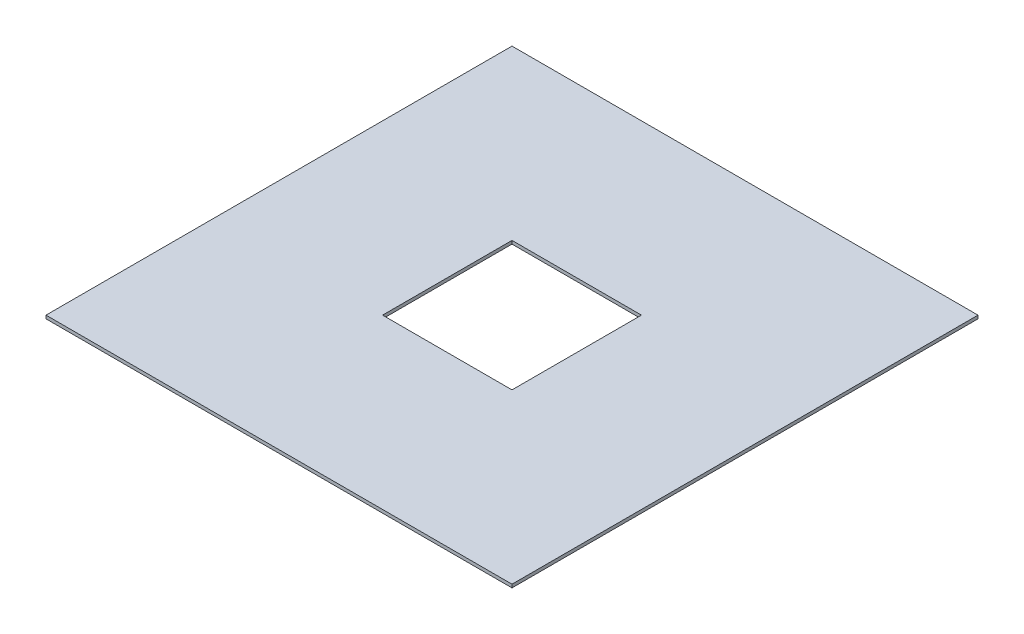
ISO-10303-21;
HEADER;
FILE_DESCRIPTION(('STEP AP214'),'2;1');
FILE_NAME('part.step','',(''),(''),'','','');
FILE_SCHEMA(('AUTOMOTIVE_DESIGN { 1 0 10303 214 1 1 1 1 }'));
ENDSEC;
DATA;
#1=APPLICATION_CONTEXT('core data for automotive mechanical design processes');
#2=APPLICATION_PROTOCOL_DEFINITION('international standard','automotive_design',2000,#1);
#3=PRODUCT_CONTEXT('',#1,'mechanical');
#4=PRODUCT('Part','Part','',(#3));
#5=PRODUCT_RELATED_PRODUCT_CATEGORY('part','',(#4));
#6=PRODUCT_DEFINITION_FORMATION('','',#4);
#7=PRODUCT_DEFINITION_CONTEXT('part definition',#1,'design');
#8=PRODUCT_DEFINITION('design','',#6,#7);
#9=PRODUCT_DEFINITION_SHAPE('','',#8);
#10=(LENGTH_UNIT() NAMED_UNIT(*) SI_UNIT(.MILLI.,.METRE.));
#11=(NAMED_UNIT(*) PLANE_ANGLE_UNIT() SI_UNIT($,.RADIAN.));
#12=(NAMED_UNIT(*) SI_UNIT($,.STERADIAN.) SOLID_ANGLE_UNIT());
#13=UNCERTAINTY_MEASURE_WITH_UNIT(LENGTH_MEASURE(1.E-05),#10,'distance_accuracy_value','');
#14=(GEOMETRIC_REPRESENTATION_CONTEXT(3) GLOBAL_UNCERTAINTY_ASSIGNED_CONTEXT((#13)) GLOBAL_UNIT_ASSIGNED_CONTEXT((#10,
#11,#12)) REPRESENTATION_CONTEXT('',''));
#15=CARTESIAN_POINT('',(0.,0.,0.));
#16=DIRECTION('',(0.,0.,1.));
#17=DIRECTION('',(1.,0.,0.));
#18=AXIS2_PLACEMENT_3D('',#15,#16,#17);
#19=CARTESIAN_POINT('',(457.2,6.35,-457.2));
#20=DIRECTION('',(-1.,0.,0.));
#21=DIRECTION('',(0.,0.,1.));
#22=AXIS2_PLACEMENT_3D('',#19,#20,#21);
#23=PLANE('',#22);
#24=DIRECTION('',(0.,0.,-1.));
#25=VECTOR('',#24,1.);
#26=CARTESIAN_POINT('',(457.2,0.,-457.2));
#27=LINE('',#26,#25);
#28=CARTESIAN_POINT('',(457.2,0.,457.2));
#29=VERTEX_POINT('',#28);
#30=CARTESIAN_POINT('',(457.2,0.,-457.2));
#31=VERTEX_POINT('',#30);
#32=EDGE_CURVE('E176',#29,#31,#27,.T.);
#33=ORIENTED_EDGE('',*,*,#32,.T.);
#34=DIRECTION('',(0.,-1.,0.));
#35=VECTOR('',#34,1.);
#36=CARTESIAN_POINT('',(457.2,6.35,-457.2));
#37=LINE('',#36,#35);
#38=CARTESIAN_POINT('',(457.2,6.35,-457.2));
#39=VERTEX_POINT('',#38);
#40=EDGE_CURVE('E12',#39,#31,#37,.T.);
#41=ORIENTED_EDGE('',*,*,#40,.F.);
#42=DIRECTION('',(0.,0.,-1.));
#43=VECTOR('',#42,1.);
#44=CARTESIAN_POINT('',(457.2,6.35,-457.2));
#45=LINE('',#44,#43);
#46=CARTESIAN_POINT('',(457.2,6.35,457.2));
#47=VERTEX_POINT('',#46);
#48=EDGE_CURVE('E264',#47,#39,#45,.T.);
#49=ORIENTED_EDGE('',*,*,#48,.F.);
#50=DIRECTION('',(0.,-1.,0.));
#51=VECTOR('',#50,1.);
#52=CARTESIAN_POINT('',(457.2,6.35,457.2));
#53=LINE('',#52,#51);
#54=EDGE_CURVE('E242',#47,#29,#53,.T.);
#55=ORIENTED_EDGE('',*,*,#54,.T.);
#56=EDGE_LOOP('',(#33,#41,#49,#55));
#57=FACE_BOUND('',#56,.T.);
#58=ADVANCED_FACE('F47',(#57),#23,.F.);
#59=CARTESIAN_POINT('',(-457.2,6.35,-457.2));
#60=DIRECTION('',(0.,0.,1.));
#61=DIRECTION('',(1.,0.,0.));
#62=AXIS2_PLACEMENT_3D('',#59,#60,#61);
#63=PLANE('',#62);
#64=DIRECTION('',(-1.,0.,0.));
#65=VECTOR('',#64,1.);
#66=CARTESIAN_POINT('',(-457.2,0.,-457.2));
#67=LINE('',#66,#65);
#68=CARTESIAN_POINT('',(-457.2,0.,-457.2));
#69=VERTEX_POINT('',#68);
#70=EDGE_CURVE('E245',#31,#69,#67,.T.);
#71=ORIENTED_EDGE('',*,*,#70,.T.);
#72=DIRECTION('',(0.,-1.,0.));
#73=VECTOR('',#72,1.);
#74=CARTESIAN_POINT('',(-457.2,6.35,-457.2));
#75=LINE('',#74,#73);
#76=CARTESIAN_POINT('',(-457.2,6.35,-457.2));
#77=VERTEX_POINT('',#76);
#78=EDGE_CURVE('E57',#77,#69,#75,.T.);
#79=ORIENTED_EDGE('',*,*,#78,.F.);
#80=DIRECTION('',(-1.,0.,0.));
#81=VECTOR('',#80,1.);
#82=CARTESIAN_POINT('',(-457.2,6.35,-457.2));
#83=LINE('',#82,#81);
#84=EDGE_CURVE('E269',#39,#77,#83,.T.);
#85=ORIENTED_EDGE('',*,*,#84,.F.);
#86=ORIENTED_EDGE('',*,*,#40,.T.);
#87=EDGE_LOOP('',(#71,#79,#85,#86));
#88=FACE_BOUND('',#87,.T.);
#89=ADVANCED_FACE('F229',(#88),#63,.F.);
#90=CARTESIAN_POINT('',(-457.2,6.35,-457.2));
#91=DIRECTION('',(1.,0.,0.));
#92=DIRECTION('',(0.,0.,-1.));
#93=AXIS2_PLACEMENT_3D('',#90,#91,#92);
#94=PLANE('',#93);
#95=DIRECTION('',(0.,0.,1.));
#96=VECTOR('',#95,1.);
#97=CARTESIAN_POINT('',(-457.2,0.,-457.2));
#98=LINE('',#97,#96);
#99=CARTESIAN_POINT('',(-457.2,0.,457.2));
#100=VERTEX_POINT('',#99);
#101=EDGE_CURVE('E250',#69,#100,#98,.T.);
#102=ORIENTED_EDGE('',*,*,#101,.T.);
#103=DIRECTION('',(0.,-1.,0.));
#104=VECTOR('',#103,1.);
#105=CARTESIAN_POINT('',(-457.2,6.35,457.2));
#106=LINE('',#105,#104);
#107=CARTESIAN_POINT('',(-457.2,6.35,457.2));
#108=VERTEX_POINT('',#107);
#109=EDGE_CURVE('E286',#108,#100,#106,.T.);
#110=ORIENTED_EDGE('',*,*,#109,.F.);
#111=DIRECTION('',(0.,0.,1.));
#112=VECTOR('',#111,1.);
#113=CARTESIAN_POINT('',(-457.2,6.35,-457.2));
#114=LINE('',#113,#112);
#115=EDGE_CURVE('E273',#77,#108,#114,.T.);
#116=ORIENTED_EDGE('',*,*,#115,.F.);
#117=ORIENTED_EDGE('',*,*,#78,.T.);
#118=EDGE_LOOP('',(#102,#110,#116,#117));
#119=FACE_BOUND('',#118,.T.);
#120=ADVANCED_FACE('F234',(#119),#94,.F.);
#121=CARTESIAN_POINT('',(-457.2,6.35,457.2));
#122=DIRECTION('',(0.,0.,-1.));
#123=DIRECTION('',(-1.,0.,0.));
#124=AXIS2_PLACEMENT_3D('',#121,#122,#123);
#125=PLANE('',#124);
#126=DIRECTION('',(1.,0.,0.));
#127=VECTOR('',#126,1.);
#128=CARTESIAN_POINT('',(-457.2,0.,457.2));
#129=LINE('',#128,#127);
#130=EDGE_CURVE('E270',#100,#29,#129,.T.);
#131=ORIENTED_EDGE('',*,*,#130,.T.);
#132=ORIENTED_EDGE('',*,*,#54,.F.);
#133=DIRECTION('',(1.,0.,0.));
#134=VECTOR('',#133,1.);
#135=CARTESIAN_POINT('',(-457.2,6.35,457.2));
#136=LINE('',#135,#134);
#137=EDGE_CURVE('E253',#108,#47,#136,.T.);
#138=ORIENTED_EDGE('',*,*,#137,.F.);
#139=ORIENTED_EDGE('',*,*,#109,.T.);
#140=EDGE_LOOP('',(#131,#132,#138,#139));
#141=FACE_BOUND('',#140,.T.);
#142=ADVANCED_FACE('F300',(#141),#125,.F.);
#143=CARTESIAN_POINT('',(0.,6.35,0.));
#144=DIRECTION('',(0.,1.,0.));
#145=DIRECTION('',(0.,0.,1.));
#146=AXIS2_PLACEMENT_3D('',#143,#144,#145);
#147=PLANE('',#146);
#148=DIRECTION('',(0.,0.,-1.));
#149=VECTOR('',#148,1.);
#150=CARTESIAN_POINT('',(127.,6.35,-127.));
#151=LINE('',#150,#149);
#152=CARTESIAN_POINT('',(127.,6.35,127.));
#153=VERTEX_POINT('',#152);
#154=CARTESIAN_POINT('',(127.,6.35,-127.));
#155=VERTEX_POINT('',#154);
#156=EDGE_CURVE('E68',#153,#155,#151,.T.);
#157=ORIENTED_EDGE('',*,*,#156,.F.);
#158=DIRECTION('',(1.,0.,0.));
#159=VECTOR('',#158,1.);
#160=CARTESIAN_POINT('',(-127.,6.35,127.));
#161=LINE('',#160,#159);
#162=CARTESIAN_POINT('',(-127.,6.35,127.));
#163=VERTEX_POINT('',#162);
#164=EDGE_CURVE('E154',#163,#153,#161,.T.);
#165=ORIENTED_EDGE('',*,*,#164,.F.);
#166=DIRECTION('',(0.,0.,1.));
#167=VECTOR('',#166,1.);
#168=CARTESIAN_POINT('',(-127.,6.35,-127.));
#169=LINE('',#168,#167);
#170=CARTESIAN_POINT('',(-127.,6.35,-127.));
#171=VERTEX_POINT('',#170);
#172=EDGE_CURVE('E160',#171,#163,#169,.T.);
#173=ORIENTED_EDGE('',*,*,#172,.F.);
#174=DIRECTION('',(-1.,0.,0.));
#175=VECTOR('',#174,1.);
#176=CARTESIAN_POINT('',(-127.,6.35,-127.));
#177=LINE('',#176,#175);
#178=EDGE_CURVE('E196',#155,#171,#177,.T.);
#179=ORIENTED_EDGE('',*,*,#178,.F.);
#180=EDGE_LOOP('',(#157,#165,#173,#179));
#181=FACE_BOUND('',#180,.T.);
#182=ORIENTED_EDGE('',*,*,#48,.T.);
#183=ORIENTED_EDGE('',*,*,#84,.T.);
#184=ORIENTED_EDGE('',*,*,#115,.T.);
#185=ORIENTED_EDGE('',*,*,#137,.T.);
#186=EDGE_LOOP('',(#182,#183,#184,#185));
#187=FACE_BOUND('',#186,.T.);
#188=ADVANCED_FACE('F214',(#181,#187),#147,.T.);
#189=CARTESIAN_POINT('',(0.,0.,0.));
#190=DIRECTION('',(0.,1.,0.));
#191=DIRECTION('',(0.,0.,1.));
#192=AXIS2_PLACEMENT_3D('',#189,#190,#191);
#193=PLANE('',#192);
#194=DIRECTION('',(1.,0.,0.));
#195=VECTOR('',#194,1.);
#196=CARTESIAN_POINT('',(-127.,0.,127.));
#197=LINE('',#196,#195);
#198=CARTESIAN_POINT('',(-127.,0.,127.));
#199=VERTEX_POINT('',#198);
#200=CARTESIAN_POINT('',(127.,0.,127.));
#201=VERTEX_POINT('',#200);
#202=EDGE_CURVE('E142',#199,#201,#197,.T.);
#203=ORIENTED_EDGE('',*,*,#202,.T.);
#204=DIRECTION('',(0.,0.,-1.));
#205=VECTOR('',#204,1.);
#206=CARTESIAN_POINT('',(127.,0.,-127.));
#207=LINE('',#206,#205);
#208=CARTESIAN_POINT('',(127.,0.,-127.));
#209=VERTEX_POINT('',#208);
#210=EDGE_CURVE('E135',#201,#209,#207,.T.);
#211=ORIENTED_EDGE('',*,*,#210,.T.);
#212=DIRECTION('',(-1.,0.,0.));
#213=VECTOR('',#212,1.);
#214=CARTESIAN_POINT('',(-127.,0.,-127.));
#215=LINE('',#214,#213);
#216=CARTESIAN_POINT('',(-127.,0.,-127.));
#217=VERTEX_POINT('',#216);
#218=EDGE_CURVE('E145',#209,#217,#215,.T.);
#219=ORIENTED_EDGE('',*,*,#218,.T.);
#220=DIRECTION('',(0.,0.,1.));
#221=VECTOR('',#220,1.);
#222=CARTESIAN_POINT('',(-127.,0.,-127.));
#223=LINE('',#222,#221);
#224=EDGE_CURVE('E79',#217,#199,#223,.T.);
#225=ORIENTED_EDGE('',*,*,#224,.T.);
#226=EDGE_LOOP('',(#203,#211,#219,#225));
#227=FACE_BOUND('',#226,.T.);
#228=ORIENTED_EDGE('',*,*,#32,.F.);
#229=ORIENTED_EDGE('',*,*,#130,.F.);
#230=ORIENTED_EDGE('',*,*,#101,.F.);
#231=ORIENTED_EDGE('',*,*,#70,.F.);
#232=EDGE_LOOP('',(#228,#229,#230,#231));
#233=FACE_BOUND('',#232,.T.);
#234=ADVANCED_FACE('F150',(#227,#233),#193,.F.);
#235=CARTESIAN_POINT('',(127.,0.,-127.));
#236=DIRECTION('',(1.,0.,0.));
#237=DIRECTION('',(0.,0.,-1.));
#238=AXIS2_PLACEMENT_3D('',#235,#236,#237);
#239=PLANE('',#238);
#240=ORIENTED_EDGE('',*,*,#156,.T.);
#241=DIRECTION('',(0.,1.,0.));
#242=VECTOR('',#241,1.);
#243=CARTESIAN_POINT('',(127.,0.,-127.));
#244=LINE('',#243,#242);
#245=EDGE_CURVE('E131',#209,#155,#244,.T.);
#246=ORIENTED_EDGE('',*,*,#245,.F.);
#247=ORIENTED_EDGE('',*,*,#210,.F.);
#248=DIRECTION('',(0.,1.,0.));
#249=VECTOR('',#248,1.);
#250=CARTESIAN_POINT('',(127.,0.,127.));
#251=LINE('',#250,#249);
#252=EDGE_CURVE('E173',#201,#153,#251,.T.);
#253=ORIENTED_EDGE('',*,*,#252,.T.);
#254=EDGE_LOOP('',(#240,#246,#247,#253));
#255=FACE_BOUND('',#254,.T.);
#256=ADVANCED_FACE('F133',(#255),#239,.F.);
#257=CARTESIAN_POINT('',(-127.,0.,127.));
#258=DIRECTION('',(0.,0.,1.));
#259=DIRECTION('',(1.,0.,0.));
#260=AXIS2_PLACEMENT_3D('',#257,#258,#259);
#261=PLANE('',#260);
#262=ORIENTED_EDGE('',*,*,#164,.T.);
#263=ORIENTED_EDGE('',*,*,#252,.F.);
#264=ORIENTED_EDGE('',*,*,#202,.F.);
#265=DIRECTION('',(0.,1.,0.));
#266=VECTOR('',#265,1.);
#267=CARTESIAN_POINT('',(-127.,0.,127.));
#268=LINE('',#267,#266);
#269=EDGE_CURVE('E177',#199,#163,#268,.T.);
#270=ORIENTED_EDGE('',*,*,#269,.T.);
#271=EDGE_LOOP('',(#262,#263,#264,#270));
#272=FACE_BOUND('',#271,.T.);
#273=ADVANCED_FACE('F217',(#272),#261,.F.);
#274=CARTESIAN_POINT('',(-127.,0.,-127.));
#275=DIRECTION('',(-1.,0.,0.));
#276=DIRECTION('',(0.,0.,1.));
#277=AXIS2_PLACEMENT_3D('',#274,#275,#276);
#278=PLANE('',#277);
#279=ORIENTED_EDGE('',*,*,#172,.T.);
#280=ORIENTED_EDGE('',*,*,#269,.F.);
#281=ORIENTED_EDGE('',*,*,#224,.F.);
#282=DIRECTION('',(0.,1.,0.));
#283=VECTOR('',#282,1.);
#284=CARTESIAN_POINT('',(-127.,0.,-127.));
#285=LINE('',#284,#283);
#286=EDGE_CURVE('E141',#217,#171,#285,.T.);
#287=ORIENTED_EDGE('',*,*,#286,.T.);
#288=EDGE_LOOP('',(#279,#280,#281,#287));
#289=FACE_BOUND('',#288,.T.);
#290=ADVANCED_FACE('F218',(#289),#278,.F.);
#291=CARTESIAN_POINT('',(-127.,0.,-127.));
#292=DIRECTION('',(0.,0.,-1.));
#293=DIRECTION('',(-1.,0.,0.));
#294=AXIS2_PLACEMENT_3D('',#291,#292,#293);
#295=PLANE('',#294);
#296=ORIENTED_EDGE('',*,*,#178,.T.);
#297=ORIENTED_EDGE('',*,*,#286,.F.);
#298=ORIENTED_EDGE('',*,*,#218,.F.);
#299=ORIENTED_EDGE('',*,*,#245,.T.);
#300=EDGE_LOOP('',(#296,#297,#298,#299));
#301=FACE_BOUND('',#300,.T.);
#302=ADVANCED_FACE('F146',(#301),#295,.F.);
#303=CLOSED_SHELL('',(#58,#89,#120,#142,#188,#234,#256,#273,#290,#302));
#304=MANIFOLD_SOLID_BREP('B2',#303);
#305=ADVANCED_BREP_SHAPE_REPRESENTATION('',(#18,#304),#14);
#306=SHAPE_DEFINITION_REPRESENTATION(#9,#305);
ENDSEC;
END-ISO-10303-21;
